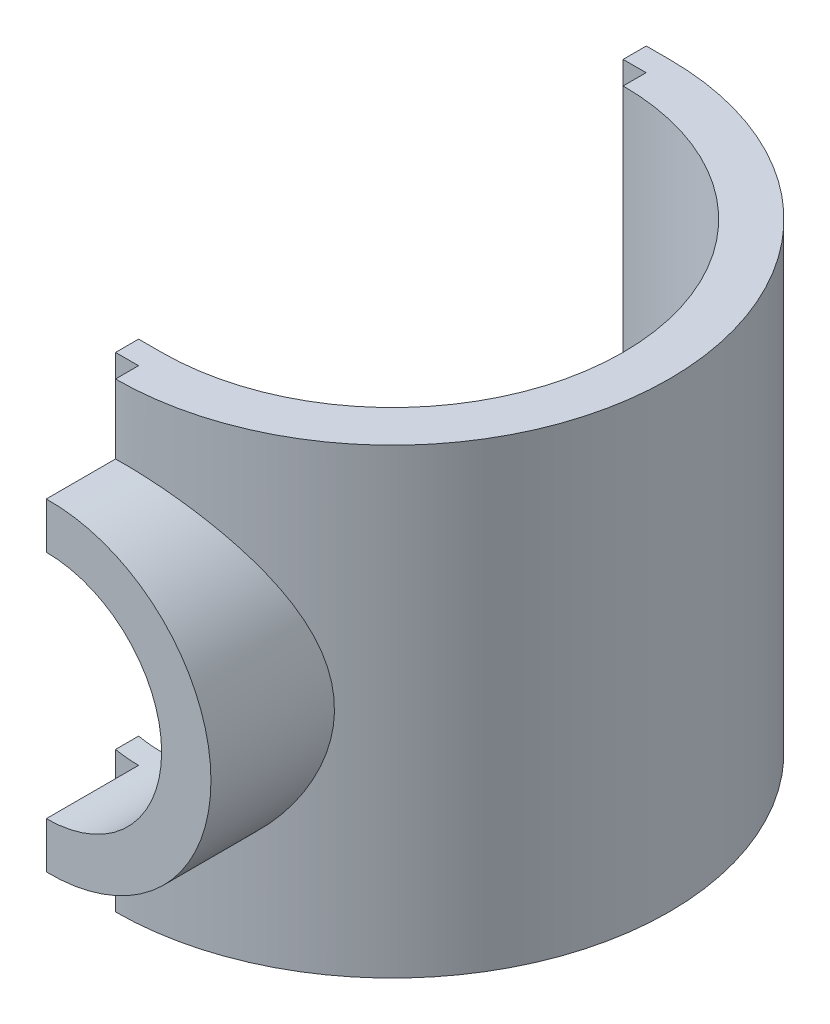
ISO-10303-21;
HEADER;
FILE_DESCRIPTION(('STEP AP214'),'2;1');
FILE_NAME('part.step','',(''),(''),'','','');
FILE_SCHEMA(('AUTOMOTIVE_DESIGN { 1 0 10303 214 1 1 1 1 }'));
ENDSEC;
DATA;
#1=APPLICATION_CONTEXT('core data for automotive mechanical design processes');
#2=APPLICATION_PROTOCOL_DEFINITION('international standard','automotive_design',2000,#1);
#3=PRODUCT_CONTEXT('',#1,'mechanical');
#4=PRODUCT('Part','Part','',(#3));
#5=PRODUCT_RELATED_PRODUCT_CATEGORY('part','',(#4));
#6=PRODUCT_DEFINITION_FORMATION('','',#4);
#7=PRODUCT_DEFINITION_CONTEXT('part definition',#1,'design');
#8=PRODUCT_DEFINITION('design','',#6,#7);
#9=PRODUCT_DEFINITION_SHAPE('','',#8);
#10=(LENGTH_UNIT() NAMED_UNIT(*) SI_UNIT(.MILLI.,.METRE.));
#11=(NAMED_UNIT(*) PLANE_ANGLE_UNIT() SI_UNIT($,.RADIAN.));
#12=(NAMED_UNIT(*) SI_UNIT($,.STERADIAN.) SOLID_ANGLE_UNIT());
#13=UNCERTAINTY_MEASURE_WITH_UNIT(LENGTH_MEASURE(1.E-05),#10,'distance_accuracy_value','');
#14=(GEOMETRIC_REPRESENTATION_CONTEXT(3) GLOBAL_UNCERTAINTY_ASSIGNED_CONTEXT((#13)) GLOBAL_UNIT_ASSIGNED_CONTEXT((#10,
#11,#12)) REPRESENTATION_CONTEXT('',''));
#15=CARTESIAN_POINT('',(0.,0.,0.));
#16=DIRECTION('',(0.,0.,1.));
#17=DIRECTION('',(1.,0.,0.));
#18=AXIS2_PLACEMENT_3D('',#15,#16,#17);
#19=CARTESIAN_POINT('',(0.,20.,10.));
#20=DIRECTION('',(1.,0.,0.));
#21=DIRECTION('',(0.,0.,-1.));
#22=AXIS2_PLACEMENT_3D('',#19,#20,#21);
#23=PLANE('',#22);
#24=DIRECTION('',(0.,-1.,0.));
#25=VECTOR('',#24,1.);
#26=CARTESIAN_POINT('',(0.,21.4157320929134,10.9995625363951));
#27=LINE('',#26,#25);
#28=CARTESIAN_POINT('',(0.,20.,10.9995625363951));
#29=VERTEX_POINT('',#28);
#30=CARTESIAN_POINT('',(0.,15.,10.9995625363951));
#31=VERTEX_POINT('',#30);
#32=EDGE_CURVE('E174',#29,#31,#27,.T.);
#33=ORIENTED_EDGE('',*,*,#32,.T.);
#34=DIRECTION('',(0.,0.,-1.));
#35=VECTOR('',#34,1.);
#36=CARTESIAN_POINT('',(0.,15.,15.));
#37=LINE('',#36,#35);
#38=CARTESIAN_POINT('',(0.,15.,15.));
#39=VERTEX_POINT('',#38);
#40=EDGE_CURVE('E163',#39,#31,#37,.T.);
#41=ORIENTED_EDGE('',*,*,#40,.F.);
#42=DIRECTION('',(0.,-1.,0.));
#43=VECTOR('',#42,1.);
#44=CARTESIAN_POINT('',(0.,16.998648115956,15.));
#45=LINE('',#44,#43);
#46=CARTESIAN_POINT('',(0.,16.998648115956,15.));
#47=VERTEX_POINT('',#46);
#48=EDGE_CURVE('E214',#47,#39,#45,.T.);
#49=ORIENTED_EDGE('',*,*,#48,.F.);
#50=DIRECTION('',(0.,0.,-1.));
#51=VECTOR('',#50,1.);
#52=CARTESIAN_POINT('',(0.,16.998648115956,15.));
#53=LINE('',#52,#51);
#54=CARTESIAN_POINT('',(0.,16.998648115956,12.));
#55=VERTEX_POINT('',#54);
#56=EDGE_CURVE('E222',#47,#55,#53,.T.);
#57=ORIENTED_EDGE('',*,*,#56,.T.);
#58=DIRECTION('',(0.,-1.,0.));
#59=VECTOR('',#58,1.);
#60=CARTESIAN_POINT('',(0.,20.,12.));
#61=LINE('',#60,#59);
#62=CARTESIAN_POINT('',(0.,20.,12.));
#63=VERTEX_POINT('',#62);
#64=EDGE_CURVE('E343',#63,#55,#61,.T.);
#65=ORIENTED_EDGE('',*,*,#64,.F.);
#66=DIRECTION('',(0.,0.,1.));
#67=VECTOR('',#66,1.);
#68=CARTESIAN_POINT('',(0.,20.,10.));
#69=LINE('',#68,#67);
#70=EDGE_CURVE('E57',#29,#63,#69,.T.);
#71=ORIENTED_EDGE('',*,*,#70,.F.);
#72=EDGE_LOOP('',(#33,#41,#49,#57,#65,#71));
#73=FACE_BOUND('',#72,.T.);
#74=ADVANCED_FACE('F33',(#73),#23,.F.);
#75=CARTESIAN_POINT('',(0.,21.4157320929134,10.));
#76=DIRECTION('',(0.,0.,1.));
#77=DIRECTION('',(1.,0.,0.));
#78=AXIS2_PLACEMENT_3D('',#75,#76,#77);
#79=PLANE('',#78);
#80=DIRECTION('',(0.,-1.,0.));
#81=VECTOR('',#80,1.);
#82=CARTESIAN_POINT('',(0.,20.,10.));
#83=LINE('',#82,#81);
#84=CARTESIAN_POINT('',(0.,20.,10.));
#85=VERTEX_POINT('',#84);
#86=CARTESIAN_POINT('',(0.,15.,10.));
#87=VERTEX_POINT('',#86);
#88=EDGE_CURVE('E169',#85,#87,#83,.T.);
#89=ORIENTED_EDGE('',*,*,#88,.T.);
#90=CARTESIAN_POINT('',(0.,10.,10.));
#91=DIRECTION('',(0.,0.,1.));
#92=DIRECTION('',(1.,0.,0.));
#93=AXIS2_PLACEMENT_3D('',#90,#91,#92);
#94=CIRCLE('',#93,5.);
#95=CARTESIAN_POINT('',(-0.997263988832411,14.8995371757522,10.));
#96=VERTEX_POINT('',#95);
#97=EDGE_CURVE('E179',#87,#96,#94,.T.);
#98=ORIENTED_EDGE('',*,*,#97,.T.);
#99=DIRECTION('',(0.,-1.,0.));
#100=VECTOR('',#99,1.);
#101=CARTESIAN_POINT('',(-0.997263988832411,21.4157320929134,10.));
#102=LINE('',#101,#100);
#103=CARTESIAN_POINT('',(-0.997263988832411,20.,10.));
#104=VERTEX_POINT('',#103);
#105=EDGE_CURVE('E284',#104,#96,#102,.T.);
#106=ORIENTED_EDGE('',*,*,#105,.F.);
#107=DIRECTION('',(-1.,0.,0.));
#108=VECTOR('',#107,1.);
#109=CARTESIAN_POINT('',(0.,20.,10.));
#110=LINE('',#109,#108);
#111=EDGE_CURVE('E279',#85,#104,#110,.T.);
#112=ORIENTED_EDGE('',*,*,#111,.F.);
#113=EDGE_LOOP('',(#89,#98,#106,#112));
#114=FACE_BOUND('',#113,.T.);
#115=ADVANCED_FACE('F265',(#114),#79,.F.);
#116=CARTESIAN_POINT('',(-0.997263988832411,21.4157320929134,10.));
#117=DIRECTION('',(1.,0.,0.));
#118=DIRECTION('',(0.,0.,-1.));
#119=AXIS2_PLACEMENT_3D('',#116,#117,#118);
#120=PLANE('',#119);
#121=ORIENTED_EDGE('',*,*,#105,.T.);
#122=DIRECTION('',(0.,0.,1.));
#123=VECTOR('',#122,1.);
#124=CARTESIAN_POINT('',(-0.997263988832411,14.8995371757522,-1.));
#125=LINE('',#124,#123);
#126=CARTESIAN_POINT('',(-0.997263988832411,14.8995371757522,10.9995625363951));
#127=VERTEX_POINT('',#126);
#128=EDGE_CURVE('E175',#96,#127,#125,.T.);
#129=ORIENTED_EDGE('',*,*,#128,.T.);
#130=DIRECTION('',(0.,-1.,0.));
#131=VECTOR('',#130,1.);
#132=CARTESIAN_POINT('',(-0.997263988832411,21.4157320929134,10.9995625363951));
#133=LINE('',#132,#131);
#134=CARTESIAN_POINT('',(-0.997263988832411,20.,10.9995625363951));
#135=VERTEX_POINT('',#134);
#136=EDGE_CURVE('E183',#135,#127,#133,.T.);
#137=ORIENTED_EDGE('',*,*,#136,.F.);
#138=DIRECTION('',(0.,0.,1.));
#139=VECTOR('',#138,1.);
#140=CARTESIAN_POINT('',(-0.997263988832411,20.,10.));
#141=LINE('',#140,#139);
#142=EDGE_CURVE('E211',#104,#135,#141,.T.);
#143=ORIENTED_EDGE('',*,*,#142,.F.);
#144=EDGE_LOOP('',(#121,#129,#137,#143));
#145=FACE_BOUND('',#144,.T.);
#146=ADVANCED_FACE('F261',(#145),#120,.F.);
#147=CARTESIAN_POINT('',(0.,21.4157320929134,10.9995625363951));
#148=DIRECTION('',(0.,0.,-1.));
#149=DIRECTION('',(-1.,0.,0.));
#150=AXIS2_PLACEMENT_3D('',#147,#148,#149);
#151=PLANE('',#150);
#152=ORIENTED_EDGE('',*,*,#136,.T.);
#153=CARTESIAN_POINT('',(0.,10.,10.9995625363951));
#154=DIRECTION('',(0.,0.,-1.));
#155=DIRECTION('',(-1.,0.,0.));
#156=AXIS2_PLACEMENT_3D('',#153,#154,#155);
#157=CIRCLE('',#156,5.);
#158=EDGE_CURVE('E11',#127,#31,#157,.T.);
#159=ORIENTED_EDGE('',*,*,#158,.T.);
#160=ORIENTED_EDGE('',*,*,#32,.F.);
#161=DIRECTION('',(1.,0.,0.));
#162=VECTOR('',#161,1.);
#163=CARTESIAN_POINT('',(0.,20.,10.9995625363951));
#164=LINE('',#163,#162);
#165=EDGE_CURVE('E276',#135,#29,#164,.T.);
#166=ORIENTED_EDGE('',*,*,#165,.F.);
#167=EDGE_LOOP('',(#152,#159,#160,#166));
#168=FACE_BOUND('',#167,.T.);
#169=ADVANCED_FACE('F257',(#168),#151,.F.);
#170=DIRECTION('',(0.,0.,-1.));
#171=VECTOR('',#170,1.);
#172=CARTESIAN_POINT('',(0.,5.,15.));
#173=LINE('',#172,#171);
#174=CARTESIAN_POINT('',(0.,5.,15.));
#175=VERTEX_POINT('',#174);
#176=CARTESIAN_POINT('',(0.,5.,10.9995625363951));
#177=VERTEX_POINT('',#176);
#178=EDGE_CURVE('E155',#175,#177,#173,.T.);
#179=ORIENTED_EDGE('',*,*,#178,.T.);
#180=CARTESIAN_POINT('',(0.,0.,10.9995625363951));
#181=VERTEX_POINT('',#180);
#182=EDGE_CURVE('E158',#177,#181,#27,.T.);
#183=ORIENTED_EDGE('',*,*,#182,.T.);
#184=DIRECTION('',(0.,0.,1.));
#185=VECTOR('',#184,1.);
#186=CARTESIAN_POINT('',(0.,0.,10.));
#187=LINE('',#186,#185);
#188=CARTESIAN_POINT('',(0.,0.,12.));
#189=VERTEX_POINT('',#188);
#190=EDGE_CURVE('E346',#181,#189,#187,.T.);
#191=ORIENTED_EDGE('',*,*,#190,.T.);
#192=CARTESIAN_POINT('',(0.,3.00135188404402,12.));
#193=VERTEX_POINT('',#192);
#194=EDGE_CURVE('E345',#193,#189,#61,.T.);
#195=ORIENTED_EDGE('',*,*,#194,.F.);
#196=DIRECTION('',(0.,0.,-1.));
#197=VECTOR('',#196,1.);
#198=CARTESIAN_POINT('',(0.,3.00135188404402,15.));
#199=LINE('',#198,#197);
#200=CARTESIAN_POINT('',(0.,3.00135188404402,15.));
#201=VERTEX_POINT('',#200);
#202=EDGE_CURVE('E164',#201,#193,#199,.T.);
#203=ORIENTED_EDGE('',*,*,#202,.F.);
#204=DIRECTION('',(0.,-1.,0.));
#205=VECTOR('',#204,1.);
#206=CARTESIAN_POINT('',(0.,5.,15.));
#207=LINE('',#206,#205);
#208=EDGE_CURVE('E161',#175,#201,#207,.T.);
#209=ORIENTED_EDGE('',*,*,#208,.F.);
#210=EDGE_LOOP('',(#179,#183,#191,#195,#203,#209));
#211=FACE_BOUND('',#210,.T.);
#212=ADVANCED_FACE('F156',(#211),#23,.F.);
#213=CARTESIAN_POINT('',(0.,20.,-10.));
#214=DIRECTION('',(1.,0.,0.));
#215=DIRECTION('',(0.,0.,-1.));
#216=AXIS2_PLACEMENT_3D('',#213,#214,#215);
#217=PLANE('',#216);
#218=DIRECTION('',(0.,-1.,0.));
#219=VECTOR('',#218,1.);
#220=CARTESIAN_POINT('',(0.,21.4157320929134,-10.9951309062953));
#221=LINE('',#220,#219);
#222=CARTESIAN_POINT('',(0.,20.,-10.9951309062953));
#223=VERTEX_POINT('',#222);
#224=CARTESIAN_POINT('',(0.,0.,-10.9951309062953));
#225=VERTEX_POINT('',#224);
#226=EDGE_CURVE('E197',#223,#225,#221,.T.);
#227=ORIENTED_EDGE('',*,*,#226,.T.);
#228=DIRECTION('',(0.,0.,1.));
#229=VECTOR('',#228,1.);
#230=CARTESIAN_POINT('',(0.,0.,-10.));
#231=LINE('',#230,#229);
#232=CARTESIAN_POINT('',(0.,0.,-10.));
#233=VERTEX_POINT('',#232);
#234=EDGE_CURVE('E369',#225,#233,#231,.T.);
#235=ORIENTED_EDGE('',*,*,#234,.T.);
#236=DIRECTION('',(0.,-1.,0.));
#237=VECTOR('',#236,1.);
#238=CARTESIAN_POINT('',(0.,20.,-10.));
#239=LINE('',#238,#237);
#240=CARTESIAN_POINT('',(0.,20.,-10.));
#241=VERTEX_POINT('',#240);
#242=EDGE_CURVE('E352',#241,#233,#239,.T.);
#243=ORIENTED_EDGE('',*,*,#242,.F.);
#244=DIRECTION('',(0.,0.,1.));
#245=VECTOR('',#244,1.);
#246=CARTESIAN_POINT('',(0.,20.,-10.));
#247=LINE('',#246,#245);
#248=EDGE_CURVE('E368',#223,#241,#247,.T.);
#249=ORIENTED_EDGE('',*,*,#248,.F.);
#250=EDGE_LOOP('',(#227,#235,#243,#249));
#251=FACE_BOUND('',#250,.T.);
#252=ADVANCED_FACE('F250',(#251),#217,.F.);
#253=CARTESIAN_POINT('',(0.,20.,0.));
#254=DIRECTION('',(0.,-1.,0.));
#255=DIRECTION('',(0.,0.,-1.));
#256=AXIS2_PLACEMENT_3D('',#253,#254,#255);
#257=CYLINDRICAL_SURFACE('',#256,10.);
#258=CARTESIAN_POINT('',(0.,5.,10.));
#259=VERTEX_POINT('',#258);
#260=CARTESIAN_POINT('',(0.,0.,10.));
#261=VERTEX_POINT('',#260);
#262=EDGE_CURVE('E350',#259,#261,#83,.T.);
#263=ORIENTED_EDGE('',*,*,#262,.F.);
#264=CARTESIAN_POINT('',(0.,5.,10.));
#265=CARTESIAN_POINT('',(0.131987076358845,4.9999776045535,10.0000241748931));
#266=CARTESIAN_POINT('',(0.2639623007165,5.0052251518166,9.99738782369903));
#267=CARTESIAN_POINT('',(0.526834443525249,5.02609185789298,9.98697207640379));
#268=CARTESIAN_POINT('',(0.657731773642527,5.04170685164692,9.97919474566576));
#269=CARTESIAN_POINT('',(0.916915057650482,5.08304694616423,9.9587210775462));
#270=CARTESIAN_POINT('',(1.04521012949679,5.10872611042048,9.94604709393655));
#271=CARTESIAN_POINT('',(1.29889259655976,5.16989629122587,9.91610743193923));
#272=CARTESIAN_POINT('',(1.42427981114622,5.20538791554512,9.89884146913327));
#273=CARTESIAN_POINT('',(1.67114695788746,5.28575657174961,9.86016491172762));
#274=CARTESIAN_POINT('',(1.79263227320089,5.33061997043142,9.83876034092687));
#275=CARTESIAN_POINT('',(2.03118834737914,5.4293369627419,9.79229658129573));
#276=CARTESIAN_POINT('',(2.14825742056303,5.48319394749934,9.76723601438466));
#277=CARTESIAN_POINT('',(2.49198806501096,5.65765500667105,9.68737302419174));
#278=CARTESIAN_POINT('',(2.7111764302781,5.79115029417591,9.62788876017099));
#279=CARTESIAN_POINT('',(3.13759208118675,6.09761359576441,9.49780310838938));
#280=CARTESIAN_POINT('',(3.34331339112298,6.27246892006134,9.42674891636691));
#281=CARTESIAN_POINT('',(3.7238994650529,6.65261040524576,9.28299460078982));
#282=CARTESIAN_POINT('',(3.89874394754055,6.85791640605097,9.21029343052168));
#283=CARTESIAN_POINT('',(4.22628588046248,7.31247794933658,9.06493777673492));
#284=CARTESIAN_POINT('',(4.37621092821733,7.56390789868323,8.99272491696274));
#285=CARTESIAN_POINT('',(4.56723713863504,7.95992598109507,8.89637237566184));
#286=CARTESIAN_POINT('',(4.62528235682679,8.09512461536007,8.8662414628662));
#287=CARTESIAN_POINT('',(4.72948947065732,8.37100440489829,8.81109555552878));
#288=CARTESIAN_POINT('',(4.77565838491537,8.51168226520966,8.78607754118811));
#289=CARTESIAN_POINT('',(4.85313763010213,8.78899122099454,8.74350585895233));
#290=CARTESIAN_POINT('',(4.88516689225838,8.92536736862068,8.72559744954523));
#291=CARTESIAN_POINT('',(4.93772467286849,9.20091938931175,8.69596394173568));
#292=CARTESIAN_POINT('',(4.95825929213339,9.34009373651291,8.68423556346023));
#293=CARTESIAN_POINT('',(4.98752342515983,9.61999946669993,8.6674619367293));
#294=CARTESIAN_POINT('',(4.99625978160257,9.76072989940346,8.66241281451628));
#295=CARTESIAN_POINT('',(5.00180406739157,10.042497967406,8.65921295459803));
#296=CARTESIAN_POINT('',(4.99861313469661,10.1835355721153,8.66106155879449));
#297=CARTESIAN_POINT('',(4.98145794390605,10.4477049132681,8.67093732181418));
#298=CARTESIAN_POINT('',(4.96883180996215,10.5709552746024,8.67819679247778));
#299=CARTESIAN_POINT('',(4.93454318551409,10.8158265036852,8.69773954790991));
#300=CARTESIAN_POINT('',(4.91287785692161,10.9374468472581,8.71002441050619));
#301=CARTESIAN_POINT('',(4.86076118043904,11.1782043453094,8.73921568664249));
#302=CARTESIAN_POINT('',(4.83031110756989,11.2973418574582,8.75612142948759));
#303=CARTESIAN_POINT('',(4.76094234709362,11.5324738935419,8.79403119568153));
#304=CARTESIAN_POINT('',(4.72202033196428,11.6484671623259,8.8150368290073));
#305=CARTESIAN_POINT('',(4.59108782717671,11.9960036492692,8.88435968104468));
#306=CARTESIAN_POINT('',(4.48609075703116,12.2216871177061,8.93828642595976));
#307=CARTESIAN_POINT('',(4.24519967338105,12.653204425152,9.0551725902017));
#308=CARTESIAN_POINT('',(4.10929093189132,12.8590287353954,9.11813630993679));
#309=CARTESIAN_POINT('',(3.79034940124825,13.2725817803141,9.25565231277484));
#310=CARTESIAN_POINT('',(3.60352713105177,13.4772453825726,9.33066191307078));
#311=CARTESIAN_POINT('',(3.19774809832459,13.8536928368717,9.47738570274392));
#312=CARTESIAN_POINT('',(2.97877409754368,14.0254589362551,9.54909809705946));
#313=CARTESIAN_POINT('',(2.62424290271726,14.2584822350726,9.65036302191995));
#314=CARTESIAN_POINT('',(2.49857972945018,14.3334294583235,9.6837382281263));
#315=CARTESIAN_POINT('',(2.24044358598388,14.4723446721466,9.74669300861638));
#316=CARTESIAN_POINT('',(2.10797363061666,14.5363174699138,9.77627424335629));
#317=CARTESIAN_POINT('',(1.83725781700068,14.6525425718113,9.83074360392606));
#318=CARTESIAN_POINT('',(1.69901955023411,14.7048097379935,9.8556376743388));
#319=CARTESIAN_POINT('',(1.4177375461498,14.7970756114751,9.90001531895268));
#320=CARTESIAN_POINT('',(1.27469565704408,14.8370789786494,9.91950094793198));
#321=CARTESIAN_POINT('',(0.945577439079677,14.9134074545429,9.95691496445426));
#322=CARTESIAN_POINT('',(0.758343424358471,14.9457982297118,9.97299046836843));
#323=CARTESIAN_POINT('',(0.475251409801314,14.9782726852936,9.98915036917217));
#324=CARTESIAN_POINT('',(0.380459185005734,14.9864122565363,9.99321148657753));
#325=CARTESIAN_POINT('',(0.190454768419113,14.9972773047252,9.99863828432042));
#326=CARTESIAN_POINT('',(0.0952424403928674,15.00000087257,10.0000030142));
#327=CARTESIAN_POINT('',(0.,15.,10.));
#328=B_SPLINE_CURVE_WITH_KNOTS('',3,(#264,#265,#266,#267,#268,#269,#270,#271,#272,#273,#274,
#275,#276,#277,#278,#279,#280,#281,#282,#283,#284,#285,#286,#287,#288,#289,#290,#291,#292,#293,
#294,#295,#296,#297,#298,#299,#300,#301,#302,#303,#304,#305,#306,#307,#308,#309,#310,#311,#312,
#313,#314,#315,#316,#317,#318,#319,#320,#321,#322,#323,#324,#325,#326,#327),.UNSPECIFIED.,.F.,
.F.,(4,2,2,2,2,2,2,2,2,2,2,2,2,2,2,2,2,2,2,2,2,2,2,2,2,2,2,2,2,2,2,4),(0.,0.395812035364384,
0.791465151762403,1.1853330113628,1.57922527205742,1.97254847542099,2.36602032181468,
3.15295337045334,3.98708662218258,4.82176575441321,5.72123159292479,6.17125755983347,
6.62101695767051,7.04409748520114,7.4669532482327,7.88956366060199,8.31213375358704,
8.68401829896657,9.05601969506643,9.42796712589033,9.80006091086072,10.5608222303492,
11.3219467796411,12.1795413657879,13.0375974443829,13.4873137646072,13.9368325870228,
14.385777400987,14.834551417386,15.4049367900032,15.6904554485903,15.9760747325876),.UNSPECIFIED.);
#329=EDGE_CURVE('E301',#259,#87,#328,.T.);
#330=ORIENTED_EDGE('',*,*,#329,.T.);
#331=ORIENTED_EDGE('',*,*,#88,.F.);
#332=CARTESIAN_POINT('',(0.,20.,0.));
#333=DIRECTION('',(0.,-1.,0.));
#334=DIRECTION('',(0.,0.,1.));
#335=AXIS2_PLACEMENT_3D('',#332,#333,#334);
#336=CIRCLE('',#335,10.);
#337=EDGE_CURVE('E234',#241,#85,#336,.T.);
#338=ORIENTED_EDGE('',*,*,#337,.F.);
#339=ORIENTED_EDGE('',*,*,#242,.T.);
#340=CARTESIAN_POINT('',(0.,0.,0.));
#341=DIRECTION('',(0.,-1.,0.));
#342=DIRECTION('',(0.,0.,1.));
#343=AXIS2_PLACEMENT_3D('',#340,#341,#342);
#344=CIRCLE('',#343,10.);
#345=EDGE_CURVE('E233',#233,#261,#344,.T.);
#346=ORIENTED_EDGE('',*,*,#345,.T.);
#347=EDGE_LOOP('',(#263,#330,#331,#338,#339,#346));
#348=FACE_BOUND('',#347,.T.);
#349=ADVANCED_FACE('F35',(#348),#257,.F.);
#350=CARTESIAN_POINT('',(0.,20.,0.));
#351=DIRECTION('',(0.,-1.,0.));
#352=DIRECTION('',(0.,0.,-1.));
#353=AXIS2_PLACEMENT_3D('',#350,#351,#352);
#354=CYLINDRICAL_SURFACE('',#353,12.);
#355=ORIENTED_EDGE('',*,*,#64,.T.);
#356=CARTESIAN_POINT('',(0.,3.00135188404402,12.));
#357=CARTESIAN_POINT('',(0.180325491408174,2.99777360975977,12.0000367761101));
#358=CARTESIAN_POINT('',(0.36077167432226,3.00123102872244,11.9959367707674));
#359=CARTESIAN_POINT('',(0.720420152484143,3.02199289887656,11.9796972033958));
#360=CARTESIAN_POINT('',(0.899622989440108,3.03929088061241,11.9675613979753));
#361=CARTESIAN_POINT('',(1.25452167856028,3.08737801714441,11.9355693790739));
#362=CARTESIAN_POINT('',(1.43023113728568,3.11809472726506,11.9157546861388));
#363=CARTESIAN_POINT('',(1.77787507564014,3.19257846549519,11.8688633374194));
#364=CARTESIAN_POINT('',(1.94980927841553,3.23634644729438,11.8417861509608));
#365=CARTESIAN_POINT('',(2.28848357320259,3.33631708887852,11.7810179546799));
#366=CARTESIAN_POINT('',(2.45523225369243,3.39249778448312,11.7473386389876));
#367=CARTESIAN_POINT('',(2.78292915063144,3.51672876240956,11.6740546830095));
#368=CARTESIAN_POINT('',(2.94387509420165,3.58478363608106,11.6344477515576));
#369=CARTESIAN_POINT('',(3.41695165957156,3.8059144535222,11.507857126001));
#370=CARTESIAN_POINT('',(3.71927998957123,3.97594431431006,11.4131112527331));
#371=CARTESIAN_POINT('',(4.31302273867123,4.36957274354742,11.202870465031));
#372=CARTESIAN_POINT('',(4.60207997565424,4.59614901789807,11.0863722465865));
#373=CARTESIAN_POINT('',(5.14047439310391,5.09036788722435,10.8472237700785));
#374=CARTESIAN_POINT('',(5.38976913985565,5.35805376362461,10.7245671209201));
#375=CARTESIAN_POINT('',(5.74454120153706,5.80430498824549,10.5366584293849));
#376=CARTESIAN_POINT('',(5.86512575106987,5.97043611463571,10.4698337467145));
#377=CARTESIAN_POINT('',(6.09182603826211,6.31366400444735,10.3395704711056));
#378=CARTESIAN_POINT('',(6.19793946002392,6.49076251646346,10.2761324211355));
#379=CARTESIAN_POINT('',(6.39466440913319,6.85492213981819,10.1548814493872));
#380=CARTESIAN_POINT('',(6.48529382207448,7.0419714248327,10.0970620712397));
#381=CARTESIAN_POINT('',(6.65019642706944,7.42528849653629,9.98922419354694));
#382=CARTESIAN_POINT('',(6.7244752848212,7.62155306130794,9.9392029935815));
#383=CARTESIAN_POINT('',(6.84038256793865,7.97553883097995,9.85965991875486));
#384=CARTESIAN_POINT('',(6.8855877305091,8.13163322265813,9.82807480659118));
#385=CARTESIAN_POINT('',(6.96523588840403,8.44774905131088,9.77178960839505));
#386=CARTESIAN_POINT('',(6.99968122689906,8.60776962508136,9.74708802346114));
#387=CARTESIAN_POINT('',(7.05734654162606,8.93064997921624,9.70541747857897));
#388=CARTESIAN_POINT('',(7.08057810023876,9.09350664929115,9.68844054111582));
#389=CARTESIAN_POINT('',(7.11553336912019,9.42111128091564,9.66279764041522));
#390=CARTESIAN_POINT('',(7.12725691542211,9.585859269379,9.65413179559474));
#391=CARTESIAN_POINT('',(7.13902580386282,9.91641475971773,9.6454323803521));
#392=CARTESIAN_POINT('',(7.13904193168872,10.0822238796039,9.64542040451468));
#393=CARTESIAN_POINT('',(7.12732264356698,10.4131955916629,9.65408326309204));
#394=CARTESIAN_POINT('',(7.11558718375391,10.57835818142,9.66275812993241));
#395=CARTESIAN_POINT('',(7.08054307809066,10.9068477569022,9.68846626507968));
#396=CARTESIAN_POINT('',(7.05723007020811,11.070174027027,9.70550268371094));
#397=CARTESIAN_POINT('',(6.99935758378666,11.3938692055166,9.74732085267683));
#398=CARTESIAN_POINT('',(6.9647935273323,11.5542368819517,9.77210575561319));
#399=CARTESIAN_POINT('',(6.8858490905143,11.8671014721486,9.82788661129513));
#400=CARTESIAN_POINT('',(6.84173132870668,12.0196949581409,9.85871463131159));
#401=CARTESIAN_POINT('',(6.74367299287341,12.3204293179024,9.92604691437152));
#402=CARTESIAN_POINT('',(6.68972921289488,12.4685687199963,9.96255302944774));
#403=CARTESIAN_POINT('',(6.51387357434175,12.9053723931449,10.0791493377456));
#404=CARTESIAN_POINT('',(6.37789731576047,13.1865786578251,10.1663470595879));
#405=CARTESIAN_POINT('',(6.04668487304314,13.7699650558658,10.3672978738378));
#406=CARTESIAN_POINT('',(5.84538401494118,14.0680056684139,10.4830603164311));
#407=CARTESIAN_POINT('',(5.51204738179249,14.4885430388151,10.659890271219));
#408=CARTESIAN_POINT('',(5.39560948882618,14.624389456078,10.7194084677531));
#409=CARTESIAN_POINT('',(5.15260030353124,14.8868614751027,10.8383110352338));
#410=CARTESIAN_POINT('',(5.02602731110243,15.0134855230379,10.8976953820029));
#411=CARTESIAN_POINT('',(4.74395459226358,15.2747861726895,11.0237073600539));
#412=CARTESIAN_POINT('',(4.58693313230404,15.4079266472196,11.090122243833));
#413=CARTESIAN_POINT('',(4.26090585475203,15.6604387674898,11.2194215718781));
#414=CARTESIAN_POINT('',(4.09190406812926,15.7798150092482,11.2823071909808));
#415=CARTESIAN_POINT('',(3.74257913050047,16.0039121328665,11.4029495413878));
#416=CARTESIAN_POINT('',(3.56225084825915,16.1086263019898,11.4607039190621));
#417=CARTESIAN_POINT('',(3.19135831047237,16.3022297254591,11.5694667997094));
#418=CARTESIAN_POINT('',(3.00079556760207,16.3911213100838,11.620476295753));
#419=CARTESIAN_POINT('',(2.61993026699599,16.5481498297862,11.7120660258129));
#420=CARTESIAN_POINT('',(2.43004252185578,16.6170701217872,11.7530256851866));
#421=CARTESIAN_POINT('',(2.04351336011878,16.7385745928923,11.8263572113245));
#422=CARTESIAN_POINT('',(1.84687321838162,16.7911618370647,11.8587306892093));
#423=CARTESIAN_POINT('',(1.44901683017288,16.8790622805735,11.9138818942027));
#424=CARTESIAN_POINT('',(1.24781437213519,16.9144217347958,11.9366852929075));
#425=CARTESIAN_POINT('',(0.842319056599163,16.9674287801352,11.9721277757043));
#426=CARTESIAN_POINT('',(0.638028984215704,16.9850914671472,11.9847755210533));
#427=CARTESIAN_POINT('',(0.361083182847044,16.9968044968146,11.9947845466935));
#428=CARTESIAN_POINT('',(0.288845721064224,16.9987386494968,11.9967411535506));
#429=CARTESIAN_POINT('',(0.144401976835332,17.0003684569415,11.9993480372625));
#430=CARTESIAN_POINT('',(0.0721957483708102,17.0000665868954,11.9999997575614));
#431=CARTESIAN_POINT('',(0.,16.998648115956,12.));
#432=B_SPLINE_CURVE_WITH_KNOTS('',3,(#356,#357,#358,#359,#360,#361,#362,#363,#364,#365,#366,
#367,#368,#369,#370,#371,#372,#373,#374,#375,#376,#377,#378,#379,#380,#381,#382,#383,#384,#385,
#386,#387,#388,#389,#390,#391,#392,#393,#394,#395,#396,#397,#398,#399,#400,#401,#402,#403,#404,
#405,#406,#407,#408,#409,#410,#411,#412,#413,#414,#415,#416,#417,#418,#419,#420,#421,#422,#423,
#424,#425,#426,#427,#428,#429,#430,#431),.UNSPECIFIED.,.F.,.F.,(4,2,2,2,2,2,2,2,2,2,2,2,2,2,2,2,
2,2,2,2,2,2,2,2,2,2,2,2,2,2,2,2,2,2,2,2,2,4),(0.,0.540872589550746,1.08149250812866,
1.61922913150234,2.15700505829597,2.69383691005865,3.23087679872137,4.3050856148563,
5.45671852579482,6.60957232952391,7.25656483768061,7.90366076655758,8.55000410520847,
9.19612312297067,9.69227945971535,10.1883276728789,10.6838624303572,11.1794042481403,
11.6761826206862,12.1729628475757,12.6699303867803,13.1671003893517,13.6520305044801,
14.1371191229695,15.1068083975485,16.2357430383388,16.8010217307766,17.3663954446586,
18.0145611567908,18.6625098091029,19.3107541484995,19.9589029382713,20.5763660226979,
21.1937131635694,21.8093935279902,22.424548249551,22.6413828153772,22.8579773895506),.UNSPECIFIED.);
#433=EDGE_CURVE('E225',#193,#55,#432,.T.);
#434=ORIENTED_EDGE('',*,*,#433,.F.);
#435=ORIENTED_EDGE('',*,*,#194,.T.);
#436=CARTESIAN_POINT('',(0.,0.,0.));
#437=DIRECTION('',(0.,1.,0.));
#438=DIRECTION('',(0.,0.,1.));
#439=AXIS2_PLACEMENT_3D('',#436,#437,#438);
#440=CIRCLE('',#439,12.);
#441=CARTESIAN_POINT('',(0.,0.,-12.));
#442=VERTEX_POINT('',#441);
#443=EDGE_CURVE('E371',#189,#442,#440,.T.);
#444=ORIENTED_EDGE('',*,*,#443,.T.);
#445=DIRECTION('',(0.,-1.,0.));
#446=VECTOR('',#445,1.);
#447=CARTESIAN_POINT('',(0.,20.,-12.));
#448=LINE('',#447,#446);
#449=CARTESIAN_POINT('',(0.,20.,-12.));
#450=VERTEX_POINT('',#449);
#451=EDGE_CURVE('E348',#450,#442,#448,.T.);
#452=ORIENTED_EDGE('',*,*,#451,.F.);
#453=CARTESIAN_POINT('',(0.,20.,0.));
#454=DIRECTION('',(0.,1.,0.));
#455=DIRECTION('',(0.,0.,1.));
#456=AXIS2_PLACEMENT_3D('',#453,#454,#455);
#457=CIRCLE('',#456,12.);
#458=EDGE_CURVE('E370',#63,#450,#457,.T.);
#459=ORIENTED_EDGE('',*,*,#458,.F.);
#460=EDGE_LOOP('',(#355,#434,#435,#444,#452,#459));
#461=FACE_BOUND('',#460,.T.);
#462=ADVANCED_FACE('F245',(#461),#354,.T.);
#463=CARTESIAN_POINT('',(0.,20.,0.));
#464=DIRECTION('',(0.,1.,0.));
#465=DIRECTION('',(0.,0.,1.));
#466=AXIS2_PLACEMENT_3D('',#463,#464,#465);
#467=PLANE('',#466);
#468=ORIENTED_EDGE('',*,*,#337,.T.);
#469=ORIENTED_EDGE('',*,*,#111,.T.);
#470=ORIENTED_EDGE('',*,*,#142,.T.);
#471=ORIENTED_EDGE('',*,*,#165,.T.);
#472=ORIENTED_EDGE('',*,*,#70,.T.);
#473=ORIENTED_EDGE('',*,*,#458,.T.);
#474=DIRECTION('',(-1.,0.,0.));
#475=VECTOR('',#474,1.);
#476=CARTESIAN_POINT('',(0.,20.,-12.));
#477=LINE('',#476,#475);
#478=CARTESIAN_POINT('',(-0.997263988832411,20.,-12.));
#479=VERTEX_POINT('',#478);
#480=EDGE_CURVE('E202',#450,#479,#477,.T.);
#481=ORIENTED_EDGE('',*,*,#480,.T.);
#482=DIRECTION('',(0.,0.,1.));
#483=VECTOR('',#482,1.);
#484=CARTESIAN_POINT('',(-0.997263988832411,20.,-12.));
#485=LINE('',#484,#483);
#486=CARTESIAN_POINT('',(-0.997263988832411,20.,-10.9951309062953));
#487=VERTEX_POINT('',#486);
#488=EDGE_CURVE('E198',#479,#487,#485,.T.);
#489=ORIENTED_EDGE('',*,*,#488,.T.);
#490=DIRECTION('',(1.,0.,0.));
#491=VECTOR('',#490,1.);
#492=CARTESIAN_POINT('',(0.,20.,-10.9951309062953));
#493=LINE('',#492,#491);
#494=EDGE_CURVE('E188',#487,#223,#493,.T.);
#495=ORIENTED_EDGE('',*,*,#494,.T.);
#496=ORIENTED_EDGE('',*,*,#248,.T.);
#497=EDGE_LOOP('',(#468,#469,#470,#471,#472,#473,#481,#489,#495,#496));
#498=FACE_BOUND('',#497,.T.);
#499=ADVANCED_FACE('F241',(#498),#467,.T.);
#500=CARTESIAN_POINT('',(0.,0.,0.));
#501=DIRECTION('',(0.,1.,0.));
#502=DIRECTION('',(0.,0.,1.));
#503=AXIS2_PLACEMENT_3D('',#500,#501,#502);
#504=PLANE('',#503);
#505=ORIENTED_EDGE('',*,*,#345,.F.);
#506=ORIENTED_EDGE('',*,*,#234,.F.);
#507=DIRECTION('',(1.,0.,0.));
#508=VECTOR('',#507,1.);
#509=CARTESIAN_POINT('',(0.,0.,-10.9951309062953));
#510=LINE('',#509,#508);
#511=CARTESIAN_POINT('',(-0.997263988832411,0.,-10.9951309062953));
#512=VERTEX_POINT('',#511);
#513=EDGE_CURVE('E185',#512,#225,#510,.T.);
#514=ORIENTED_EDGE('',*,*,#513,.F.);
#515=DIRECTION('',(0.,0.,1.));
#516=VECTOR('',#515,1.);
#517=CARTESIAN_POINT('',(-0.997263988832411,0.,-12.));
#518=LINE('',#517,#516);
#519=CARTESIAN_POINT('',(-0.997263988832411,0.,-12.));
#520=VERTEX_POINT('',#519);
#521=EDGE_CURVE('E190',#520,#512,#518,.T.);
#522=ORIENTED_EDGE('',*,*,#521,.F.);
#523=DIRECTION('',(-1.,0.,0.));
#524=VECTOR('',#523,1.);
#525=CARTESIAN_POINT('',(0.,0.,-12.));
#526=LINE('',#525,#524);
#527=EDGE_CURVE('E194',#442,#520,#526,.T.);
#528=ORIENTED_EDGE('',*,*,#527,.F.);
#529=ORIENTED_EDGE('',*,*,#443,.F.);
#530=ORIENTED_EDGE('',*,*,#190,.F.);
#531=DIRECTION('',(1.,0.,0.));
#532=VECTOR('',#531,1.);
#533=CARTESIAN_POINT('',(0.,0.,10.9995625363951));
#534=LINE('',#533,#532);
#535=CARTESIAN_POINT('',(-0.997263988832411,0.,10.9995625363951));
#536=VERTEX_POINT('',#535);
#537=EDGE_CURVE('E173',#536,#181,#534,.T.);
#538=ORIENTED_EDGE('',*,*,#537,.F.);
#539=DIRECTION('',(0.,0.,1.));
#540=VECTOR('',#539,1.);
#541=CARTESIAN_POINT('',(-0.997263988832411,0.,10.));
#542=LINE('',#541,#540);
#543=CARTESIAN_POINT('',(-0.997263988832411,0.,10.));
#544=VERTEX_POINT('',#543);
#545=EDGE_CURVE('E286',#544,#536,#542,.T.);
#546=ORIENTED_EDGE('',*,*,#545,.F.);
#547=DIRECTION('',(-1.,0.,0.));
#548=VECTOR('',#547,1.);
#549=CARTESIAN_POINT('',(0.,0.,10.));
#550=LINE('',#549,#548);
#551=EDGE_CURVE('E177',#261,#544,#550,.T.);
#552=ORIENTED_EDGE('',*,*,#551,.F.);
#553=EDGE_LOOP('',(#505,#506,#514,#522,#528,#529,#530,#538,#546,#552));
#554=FACE_BOUND('',#553,.T.);
#555=ADVANCED_FACE('F244',(#554),#504,.F.);
#556=CARTESIAN_POINT('',(0.,10.,-12.001));
#557=DIRECTION('',(0.,0.,1.));
#558=DIRECTION('',(1.,0.,0.));
#559=AXIS2_PLACEMENT_3D('',#556,#557,#558);
#560=CYLINDRICAL_SURFACE('',#559,5.);
#561=ORIENTED_EDGE('',*,*,#40,.T.);
#562=ORIENTED_EDGE('',*,*,#158,.F.);
#563=ORIENTED_EDGE('',*,*,#128,.F.);
#564=ORIENTED_EDGE('',*,*,#97,.F.);
#565=ORIENTED_EDGE('',*,*,#329,.F.);
#566=CARTESIAN_POINT('',(-0.997263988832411,5.10046282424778,10.));
#567=VERTEX_POINT('',#566);
#568=EDGE_CURVE('E308',#567,#259,#94,.T.);
#569=ORIENTED_EDGE('',*,*,#568,.F.);
#570=DIRECTION('',(0.,0.,1.));
#571=VECTOR('',#570,1.);
#572=CARTESIAN_POINT('',(-0.997263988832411,5.10046282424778,-1.));
#573=LINE('',#572,#571);
#574=CARTESIAN_POINT('',(-0.997263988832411,5.10046282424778,10.9995625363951));
#575=VERTEX_POINT('',#574);
#576=EDGE_CURVE('E49',#575,#567,#573,.F.);
#577=ORIENTED_EDGE('',*,*,#576,.F.);
#578=EDGE_CURVE('E38',#177,#575,#157,.T.);
#579=ORIENTED_EDGE('',*,*,#578,.F.);
#580=ORIENTED_EDGE('',*,*,#178,.F.);
#581=CARTESIAN_POINT('',(0.,10.,15.));
#582=DIRECTION('',(0.,0.,-1.));
#583=DIRECTION('',(1.,0.,0.));
#584=AXIS2_PLACEMENT_3D('',#581,#582,#583);
#585=CIRCLE('',#584,5.);
#586=EDGE_CURVE('E216',#39,#175,#585,.T.);
#587=ORIENTED_EDGE('',*,*,#586,.F.);
#588=EDGE_LOOP('',(#561,#562,#563,#564,#565,#569,#577,#579,#580,#587));
#589=FACE_BOUND('',#588,.T.);
#590=ADVANCED_FACE('F166',(#589),#560,.F.);
#591=CARTESIAN_POINT('',(0.137566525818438,10.,-12.001));
#592=DIRECTION('',(0.,0.,1.));
#593=DIRECTION('',(1.,0.,0.));
#594=AXIS2_PLACEMENT_3D('',#591,#592,#593);
#595=CYLINDRICAL_SURFACE('',#594,7.);
#596=ORIENTED_EDGE('',*,*,#433,.T.);
#597=ORIENTED_EDGE('',*,*,#56,.F.);
#598=CARTESIAN_POINT('',(0.137566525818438,10.,15.));
#599=DIRECTION('',(0.,0.,1.));
#600=DIRECTION('',(-1.,0.,0.));
#601=AXIS2_PLACEMENT_3D('',#598,#599,#600);
#602=CIRCLE('',#601,7.);
#603=EDGE_CURVE('E201',#201,#47,#602,.T.);
#604=ORIENTED_EDGE('',*,*,#603,.F.);
#605=ORIENTED_EDGE('',*,*,#202,.T.);
#606=EDGE_LOOP('',(#596,#597,#604,#605));
#607=FACE_BOUND('',#606,.T.);
#608=ADVANCED_FACE('F236',(#607),#595,.T.);
#609=CARTESIAN_POINT('',(0.137566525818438,10.,15.));
#610=DIRECTION('',(0.,0.,-1.));
#611=DIRECTION('',(-1.,0.,0.));
#612=AXIS2_PLACEMENT_3D('',#609,#610,#611);
#613=PLANE('',#612);
#614=ORIENTED_EDGE('',*,*,#603,.T.);
#615=ORIENTED_EDGE('',*,*,#48,.T.);
#616=ORIENTED_EDGE('',*,*,#586,.T.);
#617=ORIENTED_EDGE('',*,*,#208,.T.);
#618=EDGE_LOOP('',(#614,#615,#616,#617));
#619=FACE_BOUND('',#618,.T.);
#620=ADVANCED_FACE('F328',(#619),#613,.F.);
#621=CARTESIAN_POINT('',(0.,21.4157320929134,-12.));
#622=DIRECTION('',(0.,0.,1.));
#623=DIRECTION('',(1.,0.,0.));
#624=AXIS2_PLACEMENT_3D('',#621,#622,#623);
#625=PLANE('',#624);
#626=ORIENTED_EDGE('',*,*,#480,.F.);
#627=ORIENTED_EDGE('',*,*,#451,.T.);
#628=ORIENTED_EDGE('',*,*,#527,.T.);
#629=DIRECTION('',(0.,-1.,0.));
#630=VECTOR('',#629,1.);
#631=CARTESIAN_POINT('',(-0.997263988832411,21.4157320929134,-12.));
#632=LINE('',#631,#630);
#633=EDGE_CURVE('E193',#479,#520,#632,.T.);
#634=ORIENTED_EDGE('',*,*,#633,.F.);
#635=EDGE_LOOP('',(#626,#627,#628,#634));
#636=FACE_BOUND('',#635,.T.);
#637=ADVANCED_FACE('F324',(#636),#625,.F.);
#638=CARTESIAN_POINT('',(-0.997263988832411,21.4157320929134,-12.));
#639=DIRECTION('',(1.,0.,0.));
#640=DIRECTION('',(0.,0.,-1.));
#641=AXIS2_PLACEMENT_3D('',#638,#639,#640);
#642=PLANE('',#641);
#643=ORIENTED_EDGE('',*,*,#488,.F.);
#644=ORIENTED_EDGE('',*,*,#633,.T.);
#645=ORIENTED_EDGE('',*,*,#521,.T.);
#646=DIRECTION('',(0.,-1.,0.));
#647=VECTOR('',#646,1.);
#648=CARTESIAN_POINT('',(-0.997263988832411,21.4157320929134,-10.9951309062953));
#649=LINE('',#648,#647);
#650=EDGE_CURVE('E189',#487,#512,#649,.T.);
#651=ORIENTED_EDGE('',*,*,#650,.F.);
#652=EDGE_LOOP('',(#643,#644,#645,#651));
#653=FACE_BOUND('',#652,.T.);
#654=ADVANCED_FACE('F320',(#653),#642,.F.);
#655=CARTESIAN_POINT('',(0.,21.4157320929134,-10.9951309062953));
#656=DIRECTION('',(0.,0.,-1.));
#657=DIRECTION('',(-1.,0.,0.));
#658=AXIS2_PLACEMENT_3D('',#655,#656,#657);
#659=PLANE('',#658);
#660=ORIENTED_EDGE('',*,*,#494,.F.);
#661=ORIENTED_EDGE('',*,*,#650,.T.);
#662=ORIENTED_EDGE('',*,*,#513,.T.);
#663=ORIENTED_EDGE('',*,*,#226,.F.);
#664=EDGE_LOOP('',(#660,#661,#662,#663));
#665=FACE_BOUND('',#664,.T.);
#666=ADVANCED_FACE('F317',(#665),#659,.F.);
#667=EDGE_CURVE('E287',#567,#544,#102,.T.);
#668=ORIENTED_EDGE('',*,*,#667,.F.);
#669=ORIENTED_EDGE('',*,*,#568,.T.);
#670=ORIENTED_EDGE('',*,*,#262,.T.);
#671=ORIENTED_EDGE('',*,*,#551,.T.);
#672=EDGE_LOOP('',(#668,#669,#670,#671));
#673=FACE_BOUND('',#672,.T.);
#674=ADVANCED_FACE('F271',(#673),#79,.F.);
#675=EDGE_CURVE('E291',#575,#536,#133,.T.);
#676=ORIENTED_EDGE('',*,*,#675,.F.);
#677=ORIENTED_EDGE('',*,*,#576,.T.);
#678=ORIENTED_EDGE('',*,*,#667,.T.);
#679=ORIENTED_EDGE('',*,*,#545,.T.);
#680=EDGE_LOOP('',(#676,#677,#678,#679));
#681=FACE_BOUND('',#680,.T.);
#682=ADVANCED_FACE('F313',(#681),#120,.F.);
#683=ORIENTED_EDGE('',*,*,#182,.F.);
#684=ORIENTED_EDGE('',*,*,#578,.T.);
#685=ORIENTED_EDGE('',*,*,#675,.T.);
#686=ORIENTED_EDGE('',*,*,#537,.T.);
#687=EDGE_LOOP('',(#683,#684,#685,#686));
#688=FACE_BOUND('',#687,.T.);
#689=ADVANCED_FACE('F171',(#688),#151,.F.);
#690=CLOSED_SHELL('',(#74,#115,#146,#169,#212,#252,#349,#462,#499,#555,#590,#608,#620,#637,#654,
#666,#674,#682,#689));
#691=MANIFOLD_SOLID_BREP('B2',#690);
#692=ADVANCED_BREP_SHAPE_REPRESENTATION('',(#18,#691),#14);
#693=SHAPE_DEFINITION_REPRESENTATION(#9,#692);
ENDSEC;
END-ISO-10303-21;
